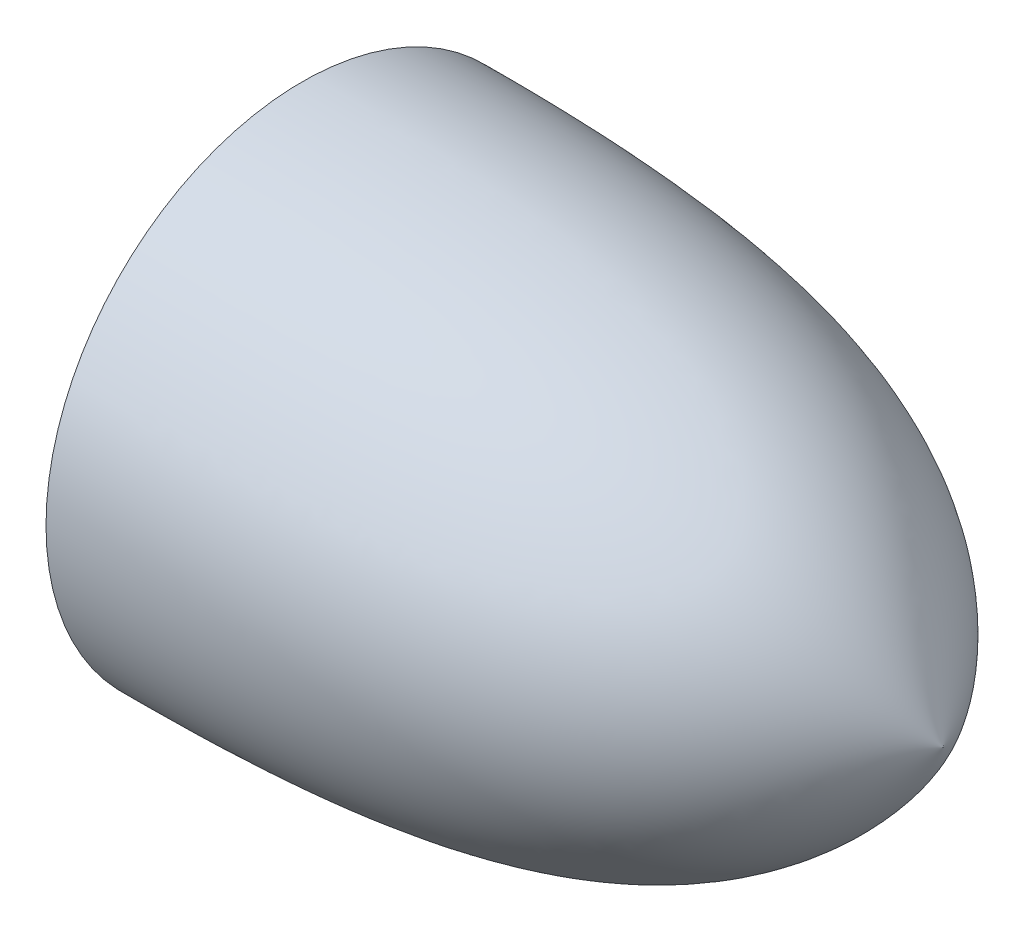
from build123d import *

# Parameters (mm, degrees)
ESQUISSE2_R             = 0.5
ENL_V_MAT_EXTRU_1_DEPTH = 3


with BuildPart() as part:
    # Esquisse1 → R_volution1 (revolve)
    with BuildSketch(Plane(origin=(0, 0, 0), x_dir=(1, 0, 0), z_dir=(0, 1, 0))):
        with BuildLine():
            Line((0, 2), (0, 0))
            Line((0, 0), (5, 0))
            add(Edge.make_bspline(
                [(0, 2), (2.655115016, 2.008645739), (4.186985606, 1.668574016), (5, 0)],
                knots=[0, 0, 0, 0, 0.789485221, 0.789485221, 0.789485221, 0.789485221], degree=3))
        make_face()
    revolve(axis=Axis((-6.109542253, 0, 0), (1, 0, 0)))

    # Esquisse2 → Enl_v. mat.-Extru.1 (cut)
    with BuildSketch(Plane.ZY):
        Circle(ESQUISSE2_R)
    extrude(amount=-ENL_V_MAT_EXTRU_1_DEPTH, mode=Mode.SUBTRACT)


solid = part.part
